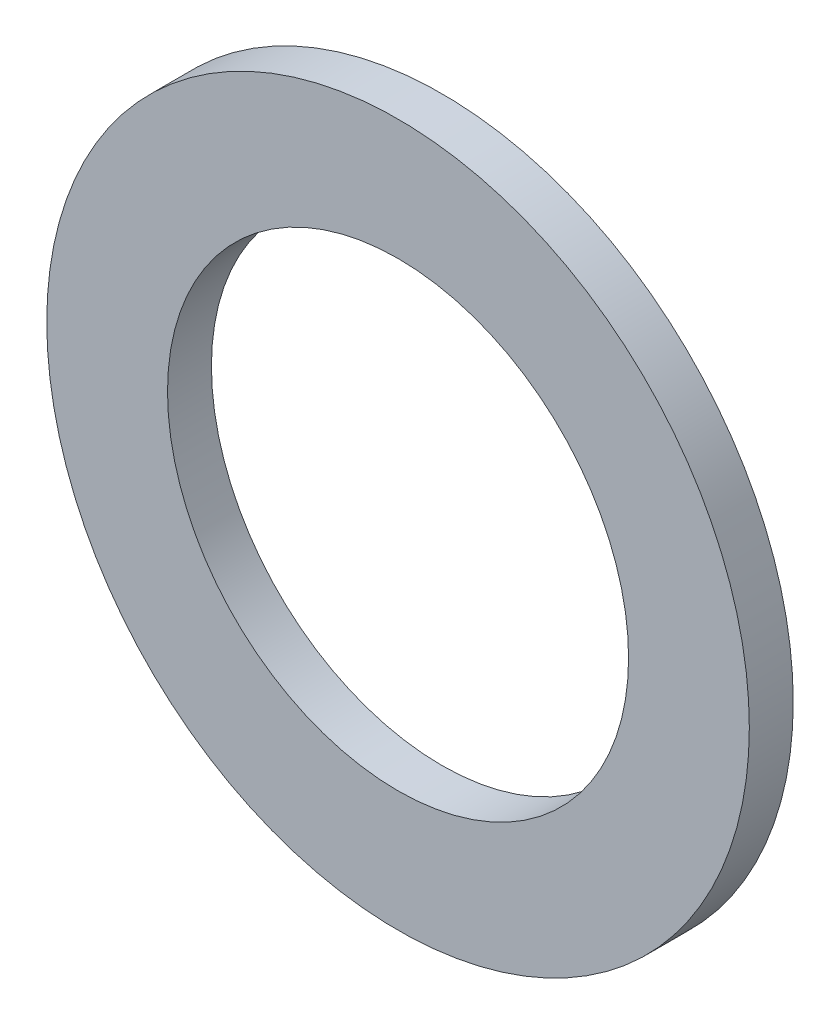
ISO-10303-21;
HEADER;
FILE_DESCRIPTION(('STEP AP214'),'2;1');
FILE_NAME('part.step','',(''),(''),'','','');
FILE_SCHEMA(('AUTOMOTIVE_DESIGN { 1 0 10303 214 1 1 1 1 }'));
ENDSEC;
DATA;
#1=APPLICATION_CONTEXT('core data for automotive mechanical design processes');
#2=APPLICATION_PROTOCOL_DEFINITION('international standard','automotive_design',2000,#1);
#3=PRODUCT_CONTEXT('',#1,'mechanical');
#4=PRODUCT('Part','Part','',(#3));
#5=PRODUCT_RELATED_PRODUCT_CATEGORY('part','',(#4));
#6=PRODUCT_DEFINITION_FORMATION('','',#4);
#7=PRODUCT_DEFINITION_CONTEXT('part definition',#1,'design');
#8=PRODUCT_DEFINITION('design','',#6,#7);
#9=PRODUCT_DEFINITION_SHAPE('','',#8);
#10=(LENGTH_UNIT() NAMED_UNIT(*) SI_UNIT(.MILLI.,.METRE.));
#11=(NAMED_UNIT(*) PLANE_ANGLE_UNIT() SI_UNIT($,.RADIAN.));
#12=(NAMED_UNIT(*) SI_UNIT($,.STERADIAN.) SOLID_ANGLE_UNIT());
#13=UNCERTAINTY_MEASURE_WITH_UNIT(LENGTH_MEASURE(1.E-05),#10,'distance_accuracy_value','');
#14=(GEOMETRIC_REPRESENTATION_CONTEXT(3) GLOBAL_UNCERTAINTY_ASSIGNED_CONTEXT((#13)) GLOBAL_UNIT_ASSIGNED_CONTEXT((#10,
#11,#12)) REPRESENTATION_CONTEXT('',''));
#15=CARTESIAN_POINT('',(0.,0.,0.));
#16=DIRECTION('',(0.,0.,1.));
#17=DIRECTION('',(1.,0.,0.));
#18=AXIS2_PLACEMENT_3D('',#15,#16,#17);
#19=CARTESIAN_POINT('',(0.,0.,-1.));
#20=DIRECTION('',(0.,0.,1.));
#21=DIRECTION('',(1.,0.,0.));
#22=AXIS2_PLACEMENT_3D('',#19,#20,#21);
#23=CYLINDRICAL_SURFACE('',#22,8.);
#24=CARTESIAN_POINT('',(0.,0.,-1.));
#25=DIRECTION('',(0.,0.,1.));
#26=DIRECTION('',(1.,0.,0.));
#27=AXIS2_PLACEMENT_3D('',#24,#25,#26);
#28=CIRCLE('',#27,8.);
#29=CARTESIAN_POINT('',(8.,0.,-1.));
#30=VERTEX_POINT('',#29);
#31=EDGE_CURVE('E10',#30,#30,#28,.T.);
#32=ORIENTED_EDGE('',*,*,#31,.T.);
#33=EDGE_LOOP('',(#32));
#34=FACE_BOUND('',#33,.T.);
#35=CARTESIAN_POINT('',(0.,0.,0.));
#36=DIRECTION('',(0.,0.,1.));
#37=DIRECTION('',(1.,0.,0.));
#38=AXIS2_PLACEMENT_3D('',#35,#36,#37);
#39=CIRCLE('',#38,8.);
#40=CARTESIAN_POINT('',(8.,0.,0.));
#41=VERTEX_POINT('',#40);
#42=EDGE_CURVE('E34',#41,#41,#39,.T.);
#43=ORIENTED_EDGE('',*,*,#42,.F.);
#44=EDGE_LOOP('',(#43));
#45=FACE_BOUND('',#44,.T.);
#46=ADVANCED_FACE('F31',(#34,#45),#23,.T.);
#47=CARTESIAN_POINT('',(0.,0.,-1.));
#48=DIRECTION('',(0.,0.,1.));
#49=DIRECTION('',(1.,0.,0.));
#50=AXIS2_PLACEMENT_3D('',#47,#48,#49);
#51=PLANE('',#50);
#52=CARTESIAN_POINT('',(0.,0.,-1.));
#53=DIRECTION('',(0.,0.,1.));
#54=DIRECTION('',(1.,0.,0.));
#55=AXIS2_PLACEMENT_3D('',#52,#53,#54);
#56=CIRCLE('',#55,5.25);
#57=CARTESIAN_POINT('',(5.25,0.,-1.));
#58=VERTEX_POINT('',#57);
#59=EDGE_CURVE('E41',#58,#58,#56,.T.);
#60=ORIENTED_EDGE('',*,*,#59,.T.);
#61=EDGE_LOOP('',(#60));
#62=FACE_BOUND('',#61,.T.);
#63=ORIENTED_EDGE('',*,*,#31,.F.);
#64=EDGE_LOOP('',(#63));
#65=FACE_BOUND('',#64,.T.);
#66=ADVANCED_FACE('F49',(#62,#65),#51,.F.);
#67=CARTESIAN_POINT('',(0.,0.,0.));
#68=DIRECTION('',(0.,0.,1.));
#69=DIRECTION('',(1.,0.,0.));
#70=AXIS2_PLACEMENT_3D('',#67,#68,#69);
#71=PLANE('',#70);
#72=CARTESIAN_POINT('',(0.,0.,0.));
#73=DIRECTION('',(0.,0.,1.));
#74=DIRECTION('',(1.,0.,0.));
#75=AXIS2_PLACEMENT_3D('',#72,#73,#74);
#76=CIRCLE('',#75,5.25);
#77=CARTESIAN_POINT('',(5.25,0.,0.));
#78=VERTEX_POINT('',#77);
#79=EDGE_CURVE('E43',#78,#78,#76,.T.);
#80=ORIENTED_EDGE('',*,*,#79,.F.);
#81=EDGE_LOOP('',(#80));
#82=FACE_BOUND('',#81,.T.);
#83=ORIENTED_EDGE('',*,*,#42,.T.);
#84=EDGE_LOOP('',(#83));
#85=FACE_BOUND('',#84,.T.);
#86=ADVANCED_FACE('F55',(#82,#85),#71,.T.);
#87=CARTESIAN_POINT('',(0.,0.,-1.));
#88=DIRECTION('',(0.,0.,1.));
#89=DIRECTION('',(1.,0.,0.));
#90=AXIS2_PLACEMENT_3D('',#87,#88,#89);
#91=CYLINDRICAL_SURFACE('',#90,5.25);
#92=ORIENTED_EDGE('',*,*,#59,.F.);
#93=EDGE_LOOP('',(#92));
#94=FACE_BOUND('',#93,.T.);
#95=ORIENTED_EDGE('',*,*,#79,.T.);
#96=EDGE_LOOP('',(#95));
#97=FACE_BOUND('',#96,.T.);
#98=ADVANCED_FACE('F52',(#94,#97),#91,.F.);
#99=CLOSED_SHELL('',(#46,#66,#86,#98));
#100=MANIFOLD_SOLID_BREP('B2',#99);
#101=ADVANCED_BREP_SHAPE_REPRESENTATION('',(#18,#100),#14);
#102=SHAPE_DEFINITION_REPRESENTATION(#9,#101);
ENDSEC;
END-ISO-10303-21;
